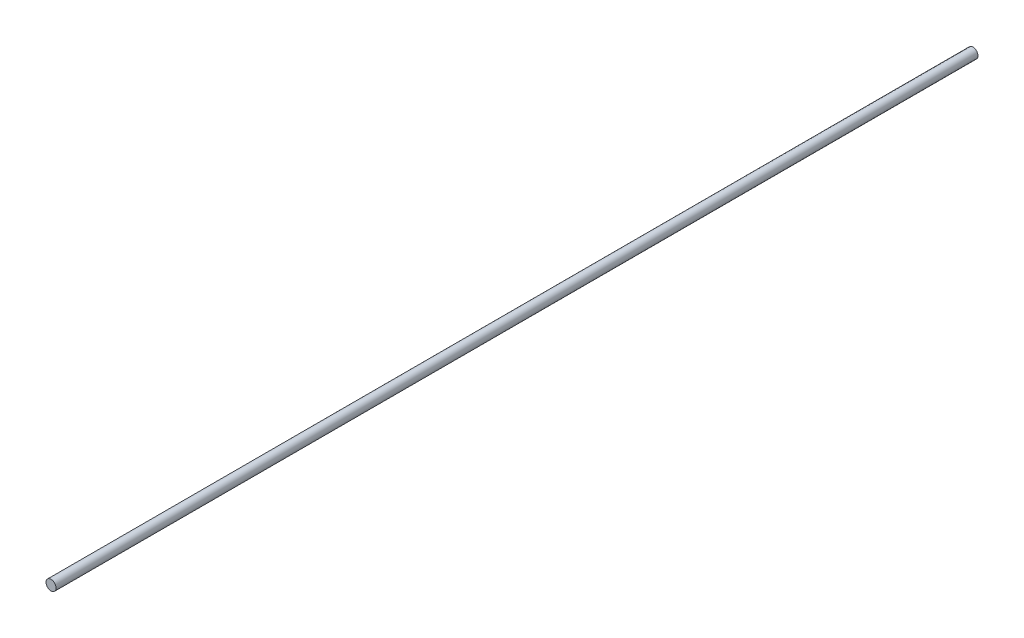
from build123d import *

# Parameters (mm, degrees)
SKETCH1_R           = 30
BOSS_EXTRUDE1_DEPTH = 5500


with BuildPart() as part:
    # Sketch1 → Boss-Extrude1 (new body)
    with BuildSketch(Plane.XY):
        Circle(SKETCH1_R)
    extrude(amount=-BOSS_EXTRUDE1_DEPTH)


solid = part.part
